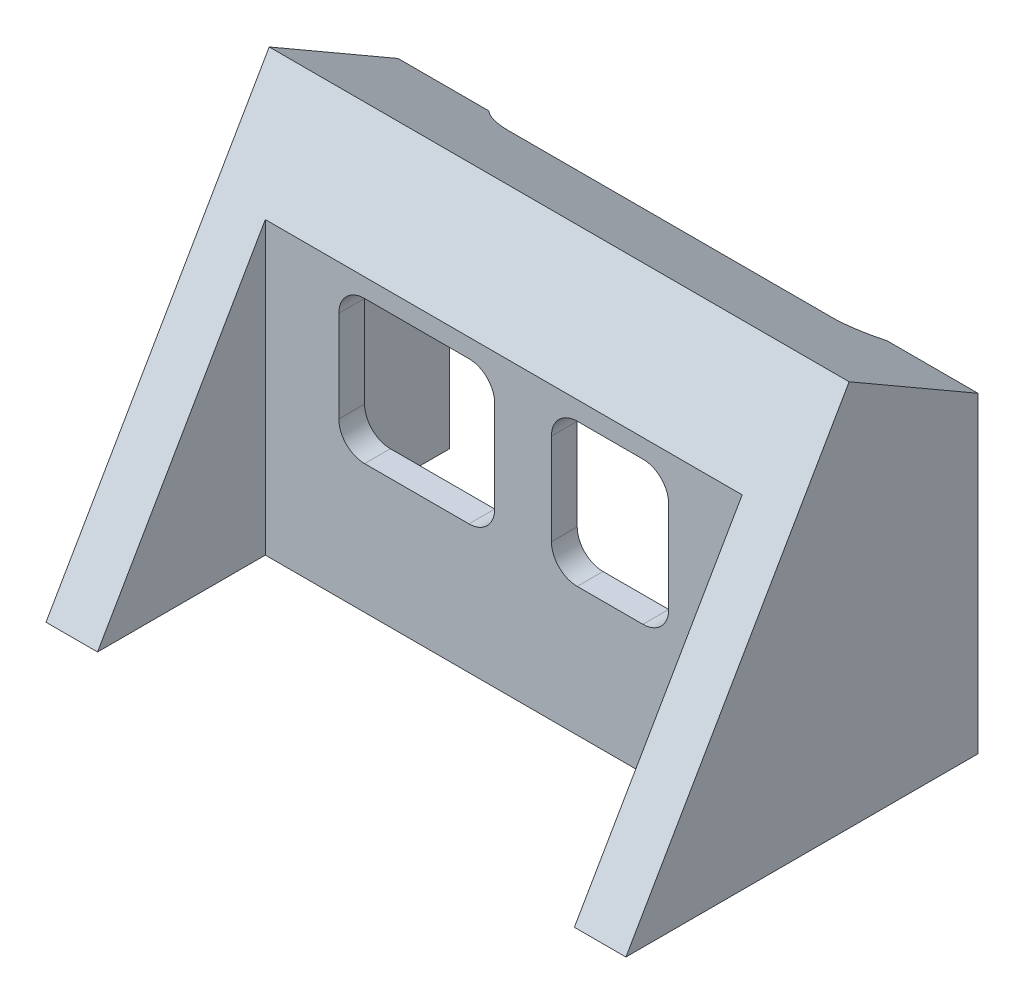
from build123d import *

# Parameters (mm, degrees)
BOSS_EXTRUDE1_DEPTH       = 22.5
CUT_EXTRUDE1_DEPTH        = 47.396768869
CUT_EXTRUDE1_DEPTH_BACK   = 47.396768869
SKETCH3_W                 = 37
SKETCH3_H                 = 12.300508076
CUT_EXTRUDE4_DEPTH        = 25
SKETCH4_W                 = 12.1
SKETCH4_H                 = 11.1
SKETCH4_W_2               = 9.1
CUT_EXTRUDE5_DEPTH        = 41.134206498
M3X0_5_TAPPED_HOLE1_D     = 2.5
M3X0_5_TAPPED_HOLE1_DEPTH = 8.5
M3X0_5_TAPPED_HOLE1_TIP   = 0.751075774
CUT_EXTRUDE6_DEPTH        = 61.592162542
FILLET1_R                 = 2
FILLET2_R                 = 6


with BuildPart() as part:
    # Sketch1 → Boss-Extrude1 (new, symmetric)
    with BuildSketch(Plane(origin=(0, 0, 0), x_dir=(0, 0, -1), z_dir=(1, 0, 0))):
        Polygon((0, 0), (17.320508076, 30), (27.320508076, 30), (27.320508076, 0), align=None)
    extrude(amount=BOSS_EXTRUDE1_DEPTH, both=True)

    # Sketch2 → Cut-Extrude1 (cut, two sides: drawn at the far end of the back side and taken through both)
    with BuildSketch(Plane(origin=(0, 0, 0), x_dir=(1, 0, 0), z_dir=(0, 1, 0)).offset(-CUT_EXTRUDE1_DEPTH_BACK)):
        Polygon((-18.5, -108.537508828), (-18.5, 0), (-18.5, 13.02), (18.5, 13.02), (18.5, 0), (18.5, -108.537508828), (18.5, -325.612526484), (-18.5, -325.612526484), align=None)
    extrude(amount=CUT_EXTRUDE1_DEPTH + CUT_EXTRUDE1_DEPTH_BACK, mode=Mode.SUBTRACT)

    # Sketch3 → Cut-Extrude4 (cut)
    with BuildSketch(Plane(origin=(0, 0, 0), x_dir=(1, 0, 0), z_dir=(0, 1, 0))):
        with Locations((0, 21.170254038)):
            Rectangle(SKETCH3_W, SKETCH3_H)
    extrude(amount=CUT_EXTRUDE4_DEPTH, mode=Mode.SUBTRACT)

    # Sketch4 → Cut-Extrude5 (cut, through all)
    with BuildSketch(Plane.XY.offset(-13.02)):
        with Locations((-6.75, 15.55)):
            Rectangle(SKETCH4_W, SKETCH4_H)
        with Locations((8.25, 15.55)):
            Rectangle(SKETCH4_W_2, SKETCH4_H)
    extrude(amount=-CUT_EXTRUDE5_DEPTH, mode=Mode.SUBTRACT)

    # M3x0.5 Tapped Hole1
    with Locations(Plane(origin=(0, 0, 0), x_dir=(-1, 0, 0), z_dir=(0, -1, 0))):
        with Locations((20.5, 7.320508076), (20.5, 22.320508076), (-20.5, 7.320508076), (-20.5, 22.320508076)):
            Hole(M3X0_5_TAPPED_HOLE1_D / 2, depth=M3X0_5_TAPPED_HOLE1_DEPTH)
            with Locations((0, 0, -(M3X0_5_TAPPED_HOLE1_DEPTH + M3X0_5_TAPPED_HOLE1_TIP / 2))):  # 118° drill point
                Cone(0, M3X0_5_TAPPED_HOLE1_D / 2, M3X0_5_TAPPED_HOLE1_TIP, mode=Mode.SUBTRACT)

    # Sketch7 → Cut-Extrude6 (cut, through all)
    with BuildSketch(Plane(origin=(22.5, 0, 0), x_dir=(0, 0, -1), z_dir=(1, 0, 0))):
        Polygon((17.320508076, 30), (27.320508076, 24.226497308), (27.320508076, 30), align=None)
    extrude(amount=-CUT_EXTRUDE6_DEPTH, mode=Mode.SUBTRACT)

    # Fillet1
    fillet1_edges = [part.edges().sort_by_distance(p)[0] for p in [
        (-12.8, 10, -14.02),
        (-12.8, 21.1, -14.02),
        (-0.7, 21.1, -14.02),
        (-0.7, 10, -14.02),
        (3.7, 10, -14.02),
        (3.7, 21.1, -14.02),
        (12.8, 21.1, -14.02),
        (12.8, 10, -14.02),
    ]]
    fillet(fillet1_edges, radius=FILLET1_R)

    # Fillet2
    fillet2_edges = [part.edges().sort_by_distance(p)[0] for p in [
        (-18.5, 25, -20.500381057),
        (18.5, 25, -20.500381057),
    ]]
    fillet(fillet2_edges, radius=FILLET2_R)


solid = part.part
